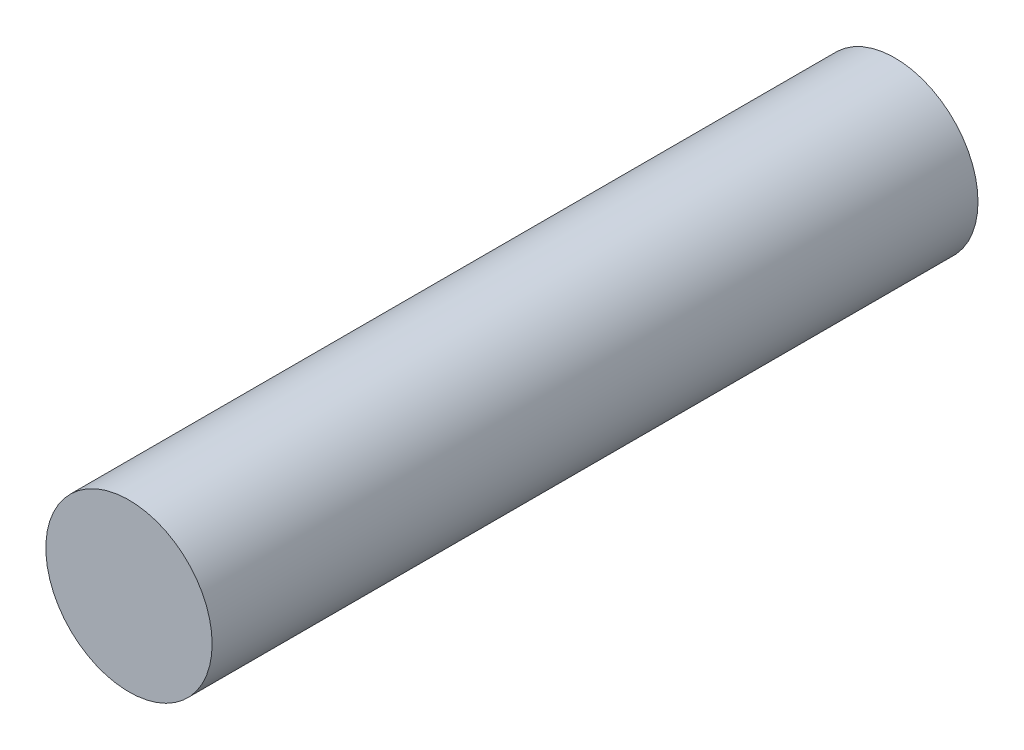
from build123d import *

# Parameters (mm, degrees)
SKETCH1_R           = 38
BOSS_EXTRUDE1_DEPTH = 175


with BuildPart() as part:
    # Sketch1 → Boss-Extrude1 (new, symmetric)
    with BuildSketch(Plane.XY):
        Circle(SKETCH1_R)
    extrude(amount=BOSS_EXTRUDE1_DEPTH, both=True)


solid = part.part
